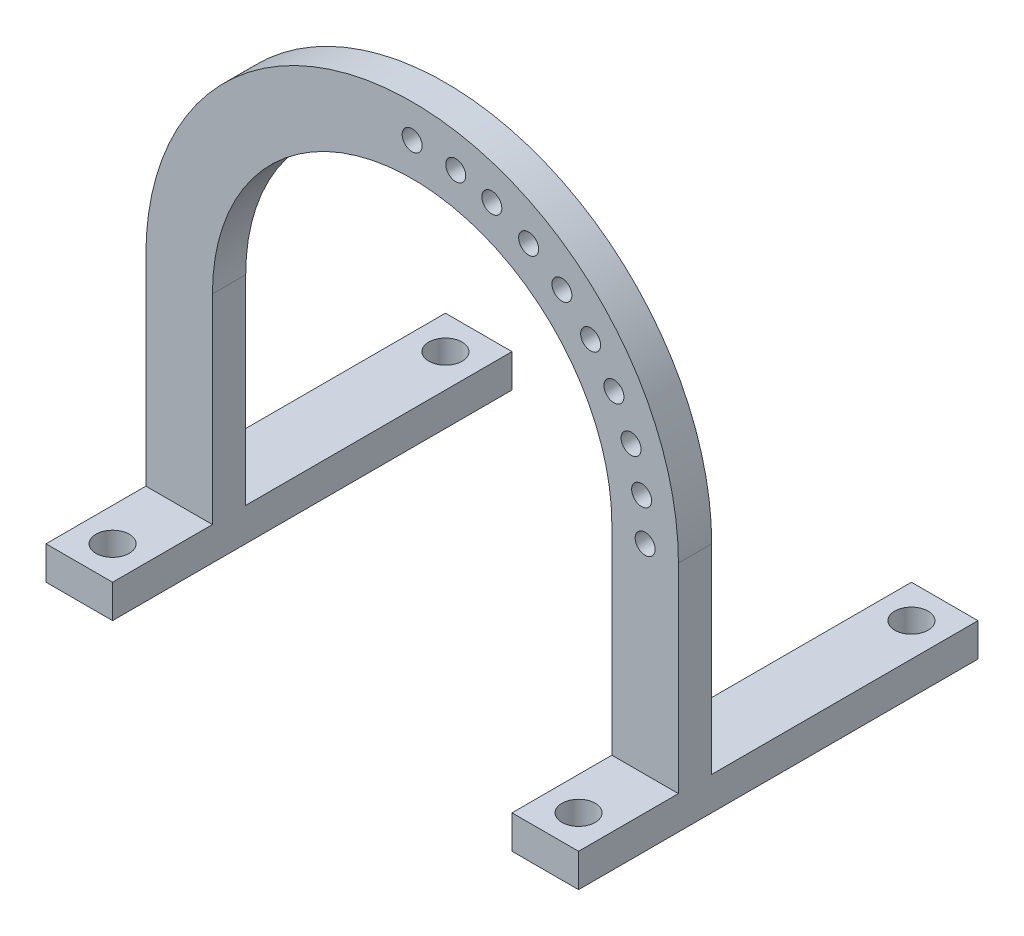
from build123d import *

# Parameters (mm, degrees)
ESQUISSE2_W             = 10
ESQUISSE2_H             = 5
ESQUISSE3_R             = 1.5
ENL_V_MAT_EXTRU_1_DEPTH = 10
BOSS_EXTRU_1_START      = -45
ESQUISSE4_W             = 10
ESQUISSE4_H             = 5
BOSS_EXTRU_1_DEPTH      = 60
ESQUISSE5_R             = 2.5
ENL_V_MAT_EXTRU_2_DEPTH = 109.786210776


with BuildPart() as part:
    # Balayage1: sweep along a path in Esquisse1
    with BuildLine(Plane.XY) as balayage1_path:
        Line((0, 0), (0, 35))
        ThreePointArc((0, 35), (30, 65), (60, 35))
        Line((60, 35), (60, 0))
    # Esquisse2 → Balayage1 (sweep)
    with BuildSketch(Plane(origin=(0, 0, 0), x_dir=(1, 0, 0), z_dir=(0, 1, 0))):
        with Locations((-5, 2.604763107)):
            Rectangle(ESQUISSE2_W, ESQUISSE2_H)
    sweep(path=balayage1_path.line)

    # Esquisse3 → Enl_v. mat.-Extru.1 (cut)
    with BuildSketch(Plane.XY.offset(-0.104763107)):
        with Locations((30, 70)):
            Circle(ESQUISSE3_R)
        with Locations((41.970705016, 67.889241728)):
            Circle(ESQUISSE3_R)
        with Locations((47.5, 65.310889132)):
            Circle(ESQUISSE3_R)
        with Locations((52.497566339, 61.811555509)):
            Circle(ESQUISSE3_R)
        with Locations((56.811555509, 57.497566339)):
            Circle(ESQUISSE3_R)
        with Locations((60.310889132, 52.5)):
            Circle(ESQUISSE3_R)
        with Locations((62.889241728, 46.970705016)):
            Circle(ESQUISSE3_R)
        with Locations((64.468271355, 41.077686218)):
            Circle(ESQUISSE3_R)
        with Locations((36.549911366, 69.381661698)):
            Circle(ESQUISSE3_R)
        with Locations((65, 35)):
            Circle(ESQUISSE3_R)
    extrude(amount=-ENL_V_MAT_EXTRU_1_DEPTH, mode=Mode.SUBTRACT)

    # Esquisse4 → Boss.-Extru.1 (add)
    with BuildSketch(Plane.XY.offset(-0.104763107).offset(BOSS_EXTRU_1_START)):
        with Locations((-5, 2.5)):
            Rectangle(ESQUISSE4_W, ESQUISSE4_H)
        with Locations((65, 2.5)):
            Rectangle(ESQUISSE4_W, ESQUISSE4_H)
    extrude(amount=BOSS_EXTRU_1_DEPTH)

    # Esquisse5 → Enl_v. mat.-Extru.2 (cut, through all)
    with BuildSketch(Plane(origin=(0, 5, 0), x_dir=(1, 0, 0), z_dir=(0, 1, 0))):
        with Locations(Location((65, -9.895236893, 0), (0, 0, 270))):
            Circle(ESQUISSE5_R)
        with Locations(Location((65, 40.104763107, 0), (0, 0, 270))):
            Circle(ESQUISSE5_R)
        with Locations(Location((-5, 40.104763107, 0), (0, 0, 270))):
            Circle(ESQUISSE5_R)
        with Locations(Location((-5, -9.895236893, 0), (0, 0, 270))):
            Circle(ESQUISSE5_R)
    extrude(amount=-ENL_V_MAT_EXTRU_2_DEPTH, mode=Mode.SUBTRACT)


solid = part.part
